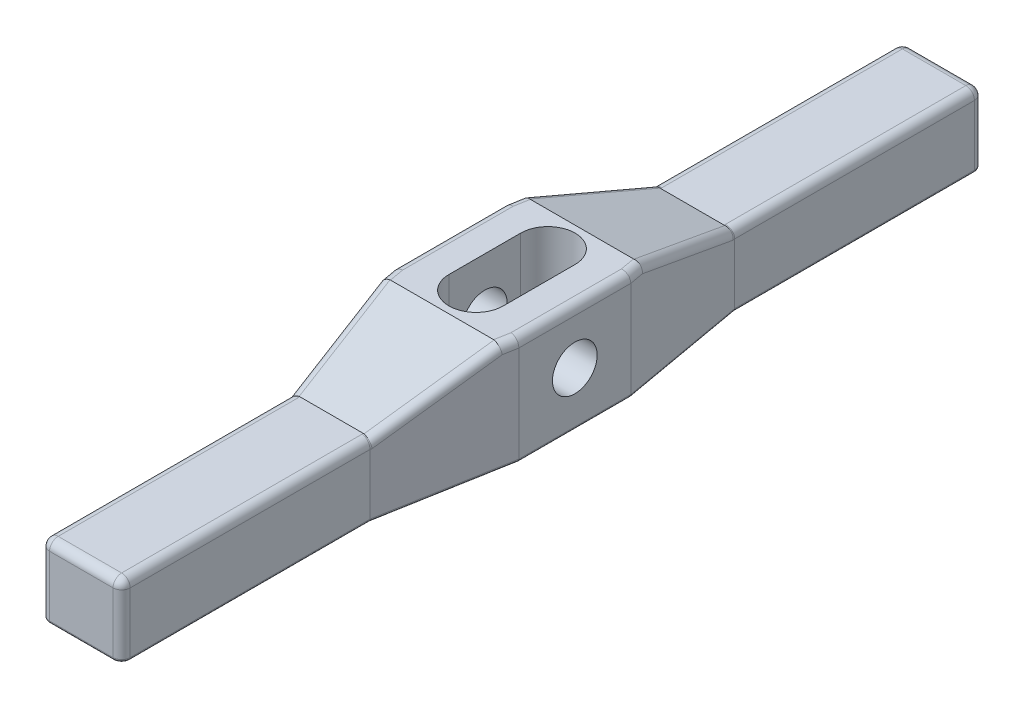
from build123d import *

# Parameters (mm, degrees)
EXTRUDE1_DEPTH     = 19.05
CUT_EXTRUDE1_DEPTH = 82.628996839
SKETCH3_R          = 3.95605
CUT_EXTRUDE2_DEPTH = 82.628996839
FILLET1_R          = 1.524
FILLET2_R          = 0.508
FILLET3_R          = 1.524


with BuildPart() as part:
    # Sketch1 → Extrude1 (new body)
    with BuildSketch(Plane(origin=(0, 0, 0), x_dir=(1, 0, 0), z_dir=(0, 1, 0))):
        Polygon((-7.1374, 76.2), (7.1374, 76.2), (7.1374, 32.258), (11.1125, 9.902952), (11.1125, -9.902952), (7.1374, -32.258), (7.1374, -76.2), (-7.1374, -76.2), (-7.1374, -32.258), (-11.1125, -9.902952), (-11.1125, 9.902952), (-7.1374, 32.258), align=None)
        with BuildLine():
            Line((-4.8133, 6.35), (-4.8133, -6.35))
            ThreePointArc((-4.8133, -6.35), (0, -11.1633), (4.8133, -6.35))
            Line((4.8133, -6.35), (4.8133, 6.35))
            ThreePointArc((4.8133, 6.35), (0, 11.1633), (-4.8133, 6.35))
        make_face(mode=Mode.SUBTRACT)
    extrude(amount=EXTRUDE1_DEPTH)

    # Sketch2 → Cut-Extrude1 (cut, through all)
    with BuildSketch(Plane(origin=(11.1125, 0, 0), x_dir=(0, 0, -1), z_dir=(1, 0, 0))):
        Polygon((76.2, 19.05), (12.3698, 19.05), (31.913090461, 12.7), (76.2, 12.7), align=None)
        Polygon((-76.2, 12.7), (-76.2, 19.05), (-12.3698, 19.05), (-31.913090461, 12.7), align=None)
    extrude(amount=-CUT_EXTRUDE1_DEPTH, mode=Mode.SUBTRACT)

    # Sketch3 → Cut-Extrude2 (cut, through all)
    with BuildSketch(Plane(origin=(11.1125, 0, 0), x_dir=(0, 0, -1), z_dir=(1, 0, 0))):
        with Locations((0, 9.525)):
            Circle(SKETCH3_R)
    extrude(amount=-CUT_EXTRUDE2_DEPTH, mode=Mode.SUBTRACT)

    # Fillet1
    fillet1_edges = [part.edges().sort_by_distance(p)[0] for p in [
        (-7.1374, 6.35, -76.2),
        (7.1374, 6.35, -76.2),
        (7.1374, 6.35, 76.2),
        (-7.1374, 6.35, 76.2),
    ]]
    fillet(fillet1_edges, radius=FILLET1_R)

    # Fillet2
    fillet2_edges = [part.edges().sort_by_distance(p)[0] for p in [
        (11.1125, 0, 0),
        (-7.1374, 0, -53.467),
        (9.12495, 0, 21.080476),
        (7.1374, 0, 53.467),
        (0, 0, 76.2),
        (0, 0, -76.2),
        (-6.691030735, 0, 75.753630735),
        (6.691030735, 0, 75.753630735),
        (6.691030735, 0, -75.753630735),
        (-6.691030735, 0, -75.753630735),
        (-7.1374, 0, 53.467),
        (-9.12495, 0, 21.080476),
        (-11.1125, 0, 0),
        (-9.12495, 0, -21.080476),
        (7.1374, 0, -53.467),
        (9.12495, 0, -21.080476),
    ]]
    fillet(fillet2_edges, radius=FILLET2_R)

    # Fillet3
    fillet3_edges = [part.edges().sort_by_distance(p)[0] for p in [
        (0, 12.7, -76.2),
        (7.1374, 12.7, -53.467),
        (6.691030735, 12.7, -75.753630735),
        (-6.691030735, 12.7, -75.753630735),
        (0, 12.7, 76.2),
        (-7.1374, 12.7, 53.467),
        (-6.691030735, 12.7, 75.753630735),
        (6.691030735, 12.7, 75.753630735),
        (-11.1125, 19.05, 0),
        (-10.893176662, 19.05, 11.136376),
        (11.1125, 19.05, 0),
        (10.893176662, 19.05, -11.136376),
        (8.936291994, 15.875, -22.141445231),
        (7.168065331, 12.7, -32.085545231),
        (-10.893176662, 19.05, -11.136376),
        (-7.168065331, 12.7, -32.085545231),
        (-7.1374, 12.7, -53.467),
        (-8.936291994, 15.875, -22.141445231),
        (10.893176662, 19.05, 11.136376),
        (8.936291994, 15.875, 22.141445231),
        (7.168065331, 12.7, 32.085545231),
        (-7.168065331, 12.7, 32.085545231),
        (7.1374, 12.7, 53.467),
        (-8.936291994, 15.875, 22.141445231),
    ]]
    fillet(fillet3_edges, radius=FILLET3_R)


solid = part.part
